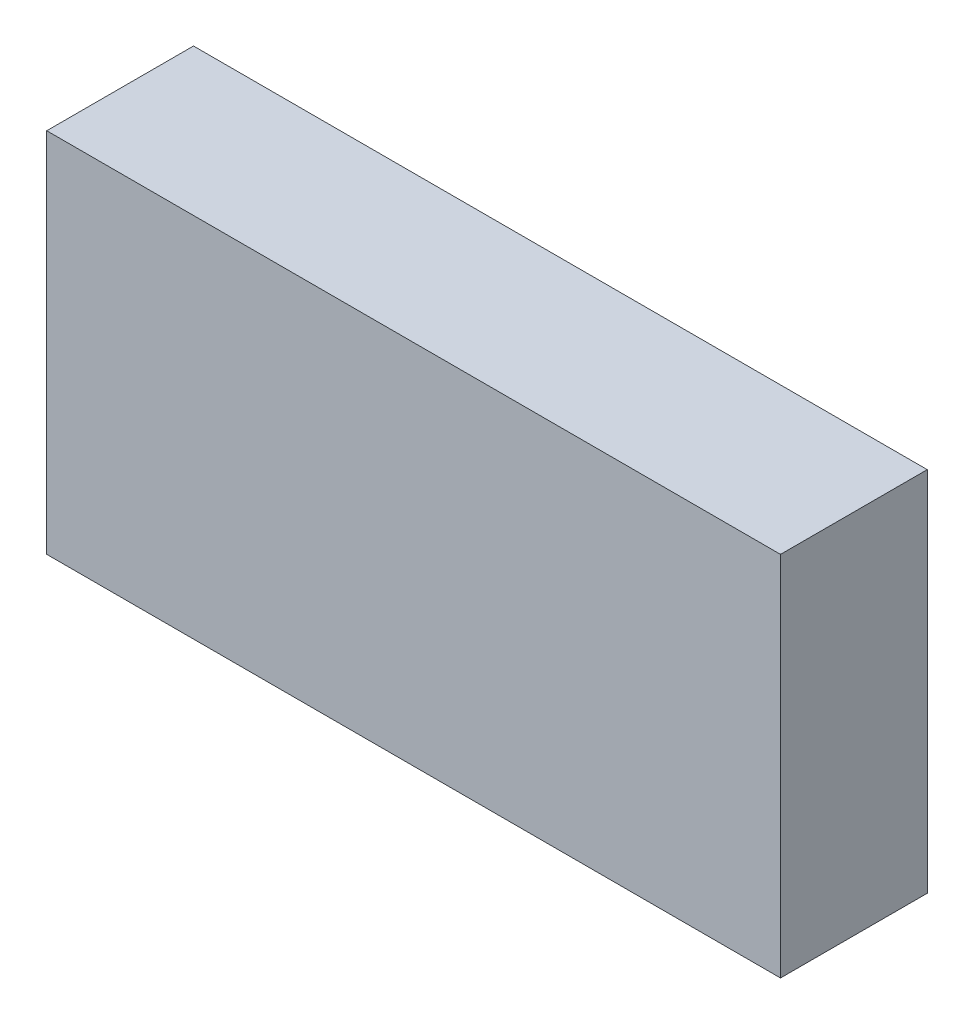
ISO-10303-21;
HEADER;
FILE_DESCRIPTION(('STEP AP214'),'2;1');
FILE_NAME('part.step','',(''),(''),'','','');
FILE_SCHEMA(('AUTOMOTIVE_DESIGN { 1 0 10303 214 1 1 1 1 }'));
ENDSEC;
DATA;
#1=APPLICATION_CONTEXT('core data for automotive mechanical design processes');
#2=APPLICATION_PROTOCOL_DEFINITION('international standard','automotive_design',2000,#1);
#3=PRODUCT_CONTEXT('',#1,'mechanical');
#4=PRODUCT('Part','Part','',(#3));
#5=PRODUCT_RELATED_PRODUCT_CATEGORY('part','',(#4));
#6=PRODUCT_DEFINITION_FORMATION('','',#4);
#7=PRODUCT_DEFINITION_CONTEXT('part definition',#1,'design');
#8=PRODUCT_DEFINITION('design','',#6,#7);
#9=PRODUCT_DEFINITION_SHAPE('','',#8);
#10=(LENGTH_UNIT() NAMED_UNIT(*) SI_UNIT(.MILLI.,.METRE.));
#11=(NAMED_UNIT(*) PLANE_ANGLE_UNIT() SI_UNIT($,.RADIAN.));
#12=(NAMED_UNIT(*) SI_UNIT($,.STERADIAN.) SOLID_ANGLE_UNIT());
#13=UNCERTAINTY_MEASURE_WITH_UNIT(LENGTH_MEASURE(1.E-05),#10,'distance_accuracy_value','');
#14=(GEOMETRIC_REPRESENTATION_CONTEXT(3) GLOBAL_UNCERTAINTY_ASSIGNED_CONTEXT((#13)) GLOBAL_UNIT_ASSIGNED_CONTEXT((#10,
#11,#12)) REPRESENTATION_CONTEXT('',''));
#15=CARTESIAN_POINT('',(0.,0.,0.));
#16=DIRECTION('',(0.,0.,1.));
#17=DIRECTION('',(1.,0.,0.));
#18=AXIS2_PLACEMENT_3D('',#15,#16,#17);
#19=CARTESIAN_POINT('',(0.,0.,10.));
#20=DIRECTION('',(1.,0.,0.));
#21=DIRECTION('',(0.,0.,-1.));
#22=AXIS2_PLACEMENT_3D('',#19,#20,#21);
#23=PLANE('',#22);
#24=DIRECTION('',(0.,-1.,0.));
#25=VECTOR('',#24,1.);
#26=CARTESIAN_POINT('',(0.,0.,0.));
#27=LINE('',#26,#25);
#28=CARTESIAN_POINT('',(0.,25.,0.));
#29=VERTEX_POINT('',#28);
#30=CARTESIAN_POINT('',(0.,0.,0.));
#31=VERTEX_POINT('',#30);
#32=EDGE_CURVE('E96',#29,#31,#27,.T.);
#33=ORIENTED_EDGE('',*,*,#32,.T.);
#34=DIRECTION('',(0.,0.,-1.));
#35=VECTOR('',#34,1.);
#36=CARTESIAN_POINT('',(0.,0.,10.));
#37=LINE('',#36,#35);
#38=CARTESIAN_POINT('',(0.,0.,10.));
#39=VERTEX_POINT('',#38);
#40=EDGE_CURVE('E11',#39,#31,#37,.T.);
#41=ORIENTED_EDGE('',*,*,#40,.F.);
#42=DIRECTION('',(0.,-1.,0.));
#43=VECTOR('',#42,1.);
#44=CARTESIAN_POINT('',(0.,0.,10.));
#45=LINE('',#44,#43);
#46=CARTESIAN_POINT('',(0.,25.,10.));
#47=VERTEX_POINT('',#46);
#48=EDGE_CURVE('E84',#47,#39,#45,.T.);
#49=ORIENTED_EDGE('',*,*,#48,.F.);
#50=DIRECTION('',(0.,0.,-1.));
#51=VECTOR('',#50,1.);
#52=CARTESIAN_POINT('',(0.,25.,10.));
#53=LINE('',#52,#51);
#54=EDGE_CURVE('E92',#47,#29,#53,.T.);
#55=ORIENTED_EDGE('',*,*,#54,.T.);
#56=EDGE_LOOP('',(#33,#41,#49,#55));
#57=FACE_BOUND('',#56,.T.);
#58=ADVANCED_FACE('F33',(#57),#23,.F.);
#59=CARTESIAN_POINT('',(0.,0.,10.));
#60=DIRECTION('',(0.,1.,0.));
#61=DIRECTION('',(0.,0.,1.));
#62=AXIS2_PLACEMENT_3D('',#59,#60,#61);
#63=PLANE('',#62);
#64=DIRECTION('',(1.,0.,0.));
#65=VECTOR('',#64,1.);
#66=CARTESIAN_POINT('',(0.,0.,0.));
#67=LINE('',#66,#65);
#68=CARTESIAN_POINT('',(50.,0.,0.));
#69=VERTEX_POINT('',#68);
#70=EDGE_CURVE('E88',#31,#69,#67,.T.);
#71=ORIENTED_EDGE('',*,*,#70,.T.);
#72=DIRECTION('',(0.,0.,-1.));
#73=VECTOR('',#72,1.);
#74=CARTESIAN_POINT('',(50.,0.,10.));
#75=LINE('',#74,#73);
#76=CARTESIAN_POINT('',(50.,0.,10.));
#77=VERTEX_POINT('',#76);
#78=EDGE_CURVE('E41',#77,#69,#75,.T.);
#79=ORIENTED_EDGE('',*,*,#78,.F.);
#80=DIRECTION('',(1.,0.,0.));
#81=VECTOR('',#80,1.);
#82=CARTESIAN_POINT('',(0.,0.,10.));
#83=LINE('',#82,#81);
#84=EDGE_CURVE('E79',#39,#77,#83,.T.);
#85=ORIENTED_EDGE('',*,*,#84,.F.);
#86=ORIENTED_EDGE('',*,*,#40,.T.);
#87=EDGE_LOOP('',(#71,#79,#85,#86));
#88=FACE_BOUND('',#87,.T.);
#89=ADVANCED_FACE('F87',(#88),#63,.F.);
#90=CARTESIAN_POINT('',(50.,0.,10.));
#91=DIRECTION('',(-1.,0.,0.));
#92=DIRECTION('',(0.,0.,1.));
#93=AXIS2_PLACEMENT_3D('',#90,#91,#92);
#94=PLANE('',#93);
#95=DIRECTION('',(0.,1.,0.));
#96=VECTOR('',#95,1.);
#97=CARTESIAN_POINT('',(50.,0.,0.));
#98=LINE('',#97,#96);
#99=CARTESIAN_POINT('',(50.,25.,0.));
#100=VERTEX_POINT('',#99);
#101=EDGE_CURVE('E66',#69,#100,#98,.T.);
#102=ORIENTED_EDGE('',*,*,#101,.T.);
#103=DIRECTION('',(0.,0.,-1.));
#104=VECTOR('',#103,1.);
#105=CARTESIAN_POINT('',(50.,25.,10.));
#106=LINE('',#105,#104);
#107=CARTESIAN_POINT('',(50.,25.,10.));
#108=VERTEX_POINT('',#107);
#109=EDGE_CURVE('E89',#108,#100,#106,.T.);
#110=ORIENTED_EDGE('',*,*,#109,.F.);
#111=DIRECTION('',(0.,1.,0.));
#112=VECTOR('',#111,1.);
#113=CARTESIAN_POINT('',(50.,0.,10.));
#114=LINE('',#113,#112);
#115=EDGE_CURVE('E82',#77,#108,#114,.T.);
#116=ORIENTED_EDGE('',*,*,#115,.F.);
#117=ORIENTED_EDGE('',*,*,#78,.T.);
#118=EDGE_LOOP('',(#102,#110,#116,#117));
#119=FACE_BOUND('',#118,.T.);
#120=ADVANCED_FACE('F90',(#119),#94,.F.);
#121=CARTESIAN_POINT('',(0.,25.,10.));
#122=DIRECTION('',(0.,-1.,0.));
#123=DIRECTION('',(0.,0.,-1.));
#124=AXIS2_PLACEMENT_3D('',#121,#122,#123);
#125=PLANE('',#124);
#126=DIRECTION('',(-1.,0.,0.));
#127=VECTOR('',#126,1.);
#128=CARTESIAN_POINT('',(0.,25.,0.));
#129=LINE('',#128,#127);
#130=EDGE_CURVE('E72',#100,#29,#129,.T.);
#131=ORIENTED_EDGE('',*,*,#130,.T.);
#132=ORIENTED_EDGE('',*,*,#54,.F.);
#133=DIRECTION('',(-1.,0.,0.));
#134=VECTOR('',#133,1.);
#135=CARTESIAN_POINT('',(0.,25.,10.));
#136=LINE('',#135,#134);
#137=EDGE_CURVE('E49',#108,#47,#136,.T.);
#138=ORIENTED_EDGE('',*,*,#137,.F.);
#139=ORIENTED_EDGE('',*,*,#109,.T.);
#140=EDGE_LOOP('',(#131,#132,#138,#139));
#141=FACE_BOUND('',#140,.T.);
#142=ADVANCED_FACE('F103',(#141),#125,.F.);
#143=CARTESIAN_POINT('',(0.,0.,10.));
#144=DIRECTION('',(0.,0.,-1.));
#145=DIRECTION('',(-1.,0.,0.));
#146=AXIS2_PLACEMENT_3D('',#143,#144,#145);
#147=PLANE('',#146);
#148=ORIENTED_EDGE('',*,*,#48,.T.);
#149=ORIENTED_EDGE('',*,*,#84,.T.);
#150=ORIENTED_EDGE('',*,*,#115,.T.);
#151=ORIENTED_EDGE('',*,*,#137,.T.);
#152=EDGE_LOOP('',(#148,#149,#150,#151));
#153=FACE_BOUND('',#152,.T.);
#154=ADVANCED_FACE('F80',(#153),#147,.F.);
#155=CARTESIAN_POINT('',(0.,0.,0.));
#156=DIRECTION('',(0.,0.,-1.));
#157=DIRECTION('',(-1.,0.,0.));
#158=AXIS2_PLACEMENT_3D('',#155,#156,#157);
#159=PLANE('',#158);
#160=ORIENTED_EDGE('',*,*,#32,.F.);
#161=ORIENTED_EDGE('',*,*,#130,.F.);
#162=ORIENTED_EDGE('',*,*,#101,.F.);
#163=ORIENTED_EDGE('',*,*,#70,.F.);
#164=EDGE_LOOP('',(#160,#161,#162,#163));
#165=FACE_BOUND('',#164,.T.);
#166=ADVANCED_FACE('F106',(#165),#159,.T.);
#167=CLOSED_SHELL('',(#58,#89,#120,#142,#154,#166));
#168=MANIFOLD_SOLID_BREP('B2',#167);
#169=ADVANCED_BREP_SHAPE_REPRESENTATION('',(#18,#168),#14);
#170=SHAPE_DEFINITION_REPRESENTATION(#9,#169);
ENDSEC;
END-ISO-10303-21;
